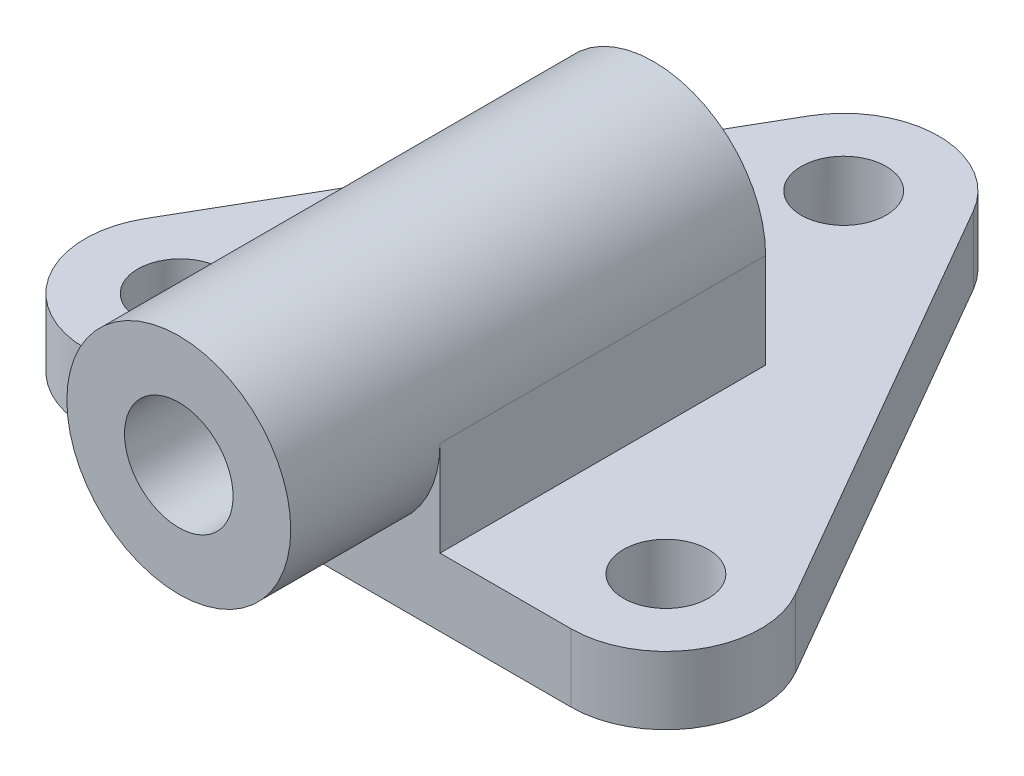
ISO-10303-21;
HEADER;
FILE_DESCRIPTION(('STEP AP214'),'2;1');
FILE_NAME('part.step','',(''),(''),'','','');
FILE_SCHEMA(('AUTOMOTIVE_DESIGN { 1 0 10303 214 1 1 1 1 }'));
ENDSEC;
DATA;
#1=APPLICATION_CONTEXT('core data for automotive mechanical design processes');
#2=APPLICATION_PROTOCOL_DEFINITION('international standard','automotive_design',2000,#1);
#3=PRODUCT_CONTEXT('',#1,'mechanical');
#4=PRODUCT('Part','Part','',(#3));
#5=PRODUCT_RELATED_PRODUCT_CATEGORY('part','',(#4));
#6=PRODUCT_DEFINITION_FORMATION('','',#4);
#7=PRODUCT_DEFINITION_CONTEXT('part definition',#1,'design');
#8=PRODUCT_DEFINITION('design','',#6,#7);
#9=PRODUCT_DEFINITION_SHAPE('','',#8);
#10=(LENGTH_UNIT() NAMED_UNIT(*) SI_UNIT(.MILLI.,.METRE.));
#11=(NAMED_UNIT(*) PLANE_ANGLE_UNIT() SI_UNIT($,.RADIAN.));
#12=(NAMED_UNIT(*) SI_UNIT($,.STERADIAN.) SOLID_ANGLE_UNIT());
#13=UNCERTAINTY_MEASURE_WITH_UNIT(LENGTH_MEASURE(1.E-05),#10,'distance_accuracy_value','');
#14=(GEOMETRIC_REPRESENTATION_CONTEXT(3) GLOBAL_UNCERTAINTY_ASSIGNED_CONTEXT((#13)) GLOBAL_UNIT_ASSIGNED_CONTEXT((#10,
#11,#12)) REPRESENTATION_CONTEXT('',''));
#15=CARTESIAN_POINT('',(0.,0.,0.));
#16=DIRECTION('',(0.,0.,1.));
#17=DIRECTION('',(1.,0.,0.));
#18=AXIS2_PLACEMENT_3D('',#15,#16,#17);
#19=CARTESIAN_POINT('',(-35.7957166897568,10.,34.6666666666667));
#20=DIRECTION('',(0.,0.,-1.));
#21=DIRECTION('',(-1.,0.,0.));
#22=AXIS2_PLACEMENT_3D('',#19,#20,#21);
#23=PLANE('',#22);
#24=CARTESIAN_POINT('',(0.,24.,34.6666666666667));
#25=DIRECTION('',(0.,0.,1.));
#26=DIRECTION('',(1.,0.,0.));
#27=AXIS2_PLACEMENT_3D('',#24,#25,#26);
#28=CIRCLE('',#27,16.5);
#29=CARTESIAN_POINT('',(-16.5,24.,34.6666666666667));
#30=VERTEX_POINT('',#29);
#31=CARTESIAN_POINT('',(16.5,24.,34.6666666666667));
#32=VERTEX_POINT('',#31);
#33=EDGE_CURVE('E131',#30,#32,#28,.T.);
#34=ORIENTED_EDGE('',*,*,#33,.F.);
#35=DIRECTION('',(0.,-1.,0.));
#36=VECTOR('',#35,1.);
#37=CARTESIAN_POINT('',(-16.5,24.,34.6666666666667));
#38=LINE('',#37,#36);
#39=CARTESIAN_POINT('',(-16.5,10.,34.6666666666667));
#40=VERTEX_POINT('',#39);
#41=EDGE_CURVE('E112',#30,#40,#38,.T.);
#42=ORIENTED_EDGE('',*,*,#41,.T.);
#43=DIRECTION('',(1.,0.,0.));
#44=VECTOR('',#43,1.);
#45=CARTESIAN_POINT('',(-35.7957166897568,10.,34.6666666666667));
#46=LINE('',#45,#44);
#47=CARTESIAN_POINT('',(-35.7957166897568,10.,34.6666666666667));
#48=VERTEX_POINT('',#47);
#49=EDGE_CURVE('E199',#48,#40,#46,.T.);
#50=ORIENTED_EDGE('',*,*,#49,.F.);
#51=DIRECTION('',(0.,-1.,0.));
#52=VECTOR('',#51,1.);
#53=CARTESIAN_POINT('',(-35.7957166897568,10.,34.6666666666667));
#54=LINE('',#53,#52);
#55=CARTESIAN_POINT('',(-35.7957166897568,0.,34.6666666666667));
#56=VERTEX_POINT('',#55);
#57=EDGE_CURVE('E226',#48,#56,#54,.T.);
#58=ORIENTED_EDGE('',*,*,#57,.T.);
#59=DIRECTION('',(1.,0.,0.));
#60=VECTOR('',#59,1.);
#61=CARTESIAN_POINT('',(-35.7957166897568,0.,34.6666666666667));
#62=LINE('',#61,#60);
#63=CARTESIAN_POINT('',(35.7957166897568,0.,34.6666666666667));
#64=VERTEX_POINT('',#63);
#65=EDGE_CURVE('E240',#56,#64,#62,.T.);
#66=ORIENTED_EDGE('',*,*,#65,.T.);
#67=DIRECTION('',(0.,-1.,0.));
#68=VECTOR('',#67,1.);
#69=CARTESIAN_POINT('',(35.7957166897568,10.,34.6666666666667));
#70=LINE('',#69,#68);
#71=CARTESIAN_POINT('',(35.7957166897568,10.,34.6666666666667));
#72=VERTEX_POINT('',#71);
#73=EDGE_CURVE('E223',#72,#64,#70,.T.);
#74=ORIENTED_EDGE('',*,*,#73,.F.);
#75=CARTESIAN_POINT('',(16.5,10.,34.6666666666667));
#76=VERTEX_POINT('',#75);
#77=EDGE_CURVE('E205',#76,#72,#46,.T.);
#78=ORIENTED_EDGE('',*,*,#77,.F.);
#79=DIRECTION('',(0.,1.,0.));
#80=VECTOR('',#79,1.);
#81=CARTESIAN_POINT('',(16.5,24.,34.6666666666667));
#82=LINE('',#81,#80);
#83=EDGE_CURVE('E50',#76,#32,#82,.T.);
#84=ORIENTED_EDGE('',*,*,#83,.T.);
#85=EDGE_LOOP('',(#34,#42,#50,#58,#66,#74,#78,#84));
#86=FACE_BOUND('',#85,.T.);
#87=ADVANCED_FACE('F33',(#86),#23,.F.);
#88=CARTESIAN_POINT('',(0.,10.,-41.3333333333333));
#89=DIRECTION('',(0.,-1.,0.));
#90=DIRECTION('',(0.,0.,-1.));
#91=AXIS2_PLACEMENT_3D('',#88,#89,#90);
#92=PLANE('',#91);
#93=CARTESIAN_POINT('',(0.,10.,-41.3333333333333));
#94=DIRECTION('',(0.,1.,0.));
#95=DIRECTION('',(0.,0.,1.));
#96=AXIS2_PLACEMENT_3D('',#93,#94,#95);
#97=CIRCLE('',#96,6.25);
#98=CARTESIAN_POINT('',(0.,10.,-35.0833333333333));
#99=VERTEX_POINT('',#98);
#100=EDGE_CURVE('E186',#99,#99,#97,.T.);
#101=ORIENTED_EDGE('',*,*,#100,.F.);
#102=EDGE_LOOP('',(#101));
#103=FACE_BOUND('',#102,.T.);
#104=CARTESIAN_POINT('',(35.7957166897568,10.,20.6666666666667));
#105=DIRECTION('',(0.,1.,0.));
#106=DIRECTION('',(0.,0.,1.));
#107=AXIS2_PLACEMENT_3D('',#104,#105,#106);
#108=CIRCLE('',#107,6.25);
#109=CARTESIAN_POINT('',(35.7957166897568,10.,26.9166666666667));
#110=VERTEX_POINT('',#109);
#111=EDGE_CURVE('E177',#110,#110,#108,.T.);
#112=ORIENTED_EDGE('',*,*,#111,.F.);
#113=EDGE_LOOP('',(#112));
#114=FACE_BOUND('',#113,.T.);
#115=CARTESIAN_POINT('',(-35.7957166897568,10.,20.6666666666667));
#116=DIRECTION('',(0.,1.,0.));
#117=DIRECTION('',(0.,0.,1.));
#118=AXIS2_PLACEMENT_3D('',#115,#116,#117);
#119=CIRCLE('',#118,6.25);
#120=CARTESIAN_POINT('',(-35.7957166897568,10.,26.9166666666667));
#121=VERTEX_POINT('',#120);
#122=EDGE_CURVE('E174',#121,#121,#119,.T.);
#123=ORIENTED_EDGE('',*,*,#122,.F.);
#124=EDGE_LOOP('',(#123));
#125=FACE_BOUND('',#124,.T.);
#126=DIRECTION('',(0.,0.,1.));
#127=VECTOR('',#126,1.);
#128=CARTESIAN_POINT('',(-16.5,10.,-13.3333333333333));
#129=LINE('',#128,#127);
#130=CARTESIAN_POINT('',(-16.5,10.,-13.3333333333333));
#131=VERTEX_POINT('',#130);
#132=EDGE_CURVE('E119',#131,#40,#129,.T.);
#133=ORIENTED_EDGE('',*,*,#132,.F.);
#134=DIRECTION('',(1.,0.,0.));
#135=VECTOR('',#134,1.);
#136=CARTESIAN_POINT('',(-16.5,10.,-13.3333333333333));
#137=LINE('',#136,#135);
#138=CARTESIAN_POINT('',(16.5,10.,-13.3333333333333));
#139=VERTEX_POINT('',#138);
#140=EDGE_CURVE('E152',#131,#139,#137,.T.);
#141=ORIENTED_EDGE('',*,*,#140,.T.);
#142=DIRECTION('',(0.,0.,1.));
#143=VECTOR('',#142,1.);
#144=CARTESIAN_POINT('',(16.5,10.,-13.3333333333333));
#145=LINE('',#144,#143);
#146=EDGE_CURVE('E160',#139,#76,#145,.T.);
#147=ORIENTED_EDGE('',*,*,#146,.T.);
#148=ORIENTED_EDGE('',*,*,#77,.T.);
#149=CARTESIAN_POINT('',(35.7957166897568,10.,20.6666666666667));
#150=DIRECTION('',(0.,1.,0.));
#151=DIRECTION('',(0.,0.,1.));
#152=AXIS2_PLACEMENT_3D('',#149,#150,#151);
#153=CIRCLE('',#152,14.);
#154=CARTESIAN_POINT('',(47.9200723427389,10.,13.6666666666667));
#155=VERTEX_POINT('',#154);
#156=EDGE_CURVE('E204',#72,#155,#153,.T.);
#157=ORIENTED_EDGE('',*,*,#156,.T.);
#158=DIRECTION('',(-0.5,0.,-0.866025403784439));
#159=VECTOR('',#158,1.);
#160=CARTESIAN_POINT('',(47.9200723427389,10.,13.6666666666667));
#161=LINE('',#160,#159);
#162=CARTESIAN_POINT('',(12.1243556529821,10.,-48.3333333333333));
#163=VERTEX_POINT('',#162);
#164=EDGE_CURVE('E58',#155,#163,#161,.T.);
#165=ORIENTED_EDGE('',*,*,#164,.T.);
#166=CARTESIAN_POINT('',(0.,10.,-41.3333333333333));
#167=DIRECTION('',(0.,1.,0.));
#168=DIRECTION('',(0.,0.,-1.));
#169=AXIS2_PLACEMENT_3D('',#166,#167,#168);
#170=CIRCLE('',#169,14.);
#171=CARTESIAN_POINT('',(-12.1243556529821,10.,-48.3333333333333));
#172=VERTEX_POINT('',#171);
#173=EDGE_CURVE('E249',#163,#172,#170,.T.);
#174=ORIENTED_EDGE('',*,*,#173,.T.);
#175=DIRECTION('',(-0.5,0.,0.866025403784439));
#176=VECTOR('',#175,1.);
#177=CARTESIAN_POINT('',(-12.1243556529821,10.,-48.3333333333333));
#178=LINE('',#177,#176);
#179=CARTESIAN_POINT('',(-47.9200723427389,10.,13.6666666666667));
#180=VERTEX_POINT('',#179);
#181=EDGE_CURVE('E250',#172,#180,#178,.T.);
#182=ORIENTED_EDGE('',*,*,#181,.T.);
#183=CARTESIAN_POINT('',(-35.7957166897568,10.,20.6666666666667));
#184=DIRECTION('',(0.,1.,0.));
#185=DIRECTION('',(0.,0.,1.));
#186=AXIS2_PLACEMENT_3D('',#183,#184,#185);
#187=CIRCLE('',#186,14.);
#188=EDGE_CURVE('E201',#180,#48,#187,.T.);
#189=ORIENTED_EDGE('',*,*,#188,.T.);
#190=ORIENTED_EDGE('',*,*,#49,.T.);
#191=EDGE_LOOP('',(#133,#141,#147,#148,#157,#165,#174,#182,#189,#190));
#192=FACE_BOUND('',#191,.T.);
#193=ADVANCED_FACE('F193',(#103,#114,#125,#192),#92,.F.);
#194=CARTESIAN_POINT('',(0.,10.,-41.3333333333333));
#195=DIRECTION('',(0.,-1.,0.));
#196=DIRECTION('',(0.,0.,-1.));
#197=AXIS2_PLACEMENT_3D('',#194,#195,#196);
#198=CYLINDRICAL_SURFACE('',#197,14.);
#199=CARTESIAN_POINT('',(0.,0.,-41.3333333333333));
#200=DIRECTION('',(0.,1.,0.));
#201=DIRECTION('',(0.,0.,-1.));
#202=AXIS2_PLACEMENT_3D('',#199,#200,#201);
#203=CIRCLE('',#202,14.);
#204=CARTESIAN_POINT('',(12.1243556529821,0.,-48.3333333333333));
#205=VERTEX_POINT('',#204);
#206=CARTESIAN_POINT('',(-12.1243556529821,0.,-48.3333333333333));
#207=VERTEX_POINT('',#206);
#208=EDGE_CURVE('E159',#205,#207,#203,.T.);
#209=ORIENTED_EDGE('',*,*,#208,.T.);
#210=DIRECTION('',(0.,-1.,0.));
#211=VECTOR('',#210,1.);
#212=CARTESIAN_POINT('',(-12.1243556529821,10.,-48.3333333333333));
#213=LINE('',#212,#211);
#214=EDGE_CURVE('E11',#172,#207,#213,.T.);
#215=ORIENTED_EDGE('',*,*,#214,.F.);
#216=ORIENTED_EDGE('',*,*,#173,.F.);
#217=DIRECTION('',(0.,-1.,0.));
#218=VECTOR('',#217,1.);
#219=CARTESIAN_POINT('',(12.1243556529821,10.,-48.3333333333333));
#220=LINE('',#219,#218);
#221=EDGE_CURVE('E217',#163,#205,#220,.T.);
#222=ORIENTED_EDGE('',*,*,#221,.T.);
#223=EDGE_LOOP('',(#209,#215,#216,#222));
#224=FACE_BOUND('',#223,.T.);
#225=ADVANCED_FACE('F35',(#224),#198,.T.);
#226=CARTESIAN_POINT('',(-12.1243556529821,10.,-48.3333333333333));
#227=DIRECTION('',(0.866025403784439,0.,0.5));
#228=DIRECTION('',(0.5,0.,-0.866025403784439));
#229=AXIS2_PLACEMENT_3D('',#226,#227,#228);
#230=PLANE('',#229);
#231=DIRECTION('',(-0.5,0.,0.866025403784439));
#232=VECTOR('',#231,1.);
#233=CARTESIAN_POINT('',(-12.1243556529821,0.,-48.3333333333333));
#234=LINE('',#233,#232);
#235=CARTESIAN_POINT('',(-47.9200723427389,0.,13.6666666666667));
#236=VERTEX_POINT('',#235);
#237=EDGE_CURVE('E238',#207,#236,#234,.T.);
#238=ORIENTED_EDGE('',*,*,#237,.T.);
#239=DIRECTION('',(0.,-1.,0.));
#240=VECTOR('',#239,1.);
#241=CARTESIAN_POINT('',(-47.9200723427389,10.,13.6666666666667));
#242=LINE('',#241,#240);
#243=EDGE_CURVE('E42',#180,#236,#242,.T.);
#244=ORIENTED_EDGE('',*,*,#243,.F.);
#245=ORIENTED_EDGE('',*,*,#181,.F.);
#246=ORIENTED_EDGE('',*,*,#214,.T.);
#247=EDGE_LOOP('',(#238,#244,#245,#246));
#248=FACE_BOUND('',#247,.T.);
#249=ADVANCED_FACE('F253',(#248),#230,.F.);
#250=CARTESIAN_POINT('',(-35.7957166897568,10.,20.6666666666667));
#251=DIRECTION('',(0.,-1.,0.));
#252=DIRECTION('',(0.,0.,-1.));
#253=AXIS2_PLACEMENT_3D('',#250,#251,#252);
#254=CYLINDRICAL_SURFACE('',#253,14.);
#255=CARTESIAN_POINT('',(-35.7957166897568,0.,20.6666666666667));
#256=DIRECTION('',(0.,1.,0.));
#257=DIRECTION('',(0.,0.,1.));
#258=AXIS2_PLACEMENT_3D('',#255,#256,#257);
#259=CIRCLE('',#258,14.);
#260=EDGE_CURVE('E232',#236,#56,#259,.T.);
#261=ORIENTED_EDGE('',*,*,#260,.T.);
#262=ORIENTED_EDGE('',*,*,#57,.F.);
#263=ORIENTED_EDGE('',*,*,#188,.F.);
#264=ORIENTED_EDGE('',*,*,#243,.T.);
#265=EDGE_LOOP('',(#261,#262,#263,#264));
#266=FACE_BOUND('',#265,.T.);
#267=ADVANCED_FACE('F231',(#266),#254,.T.);
#268=CARTESIAN_POINT('',(35.7957166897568,10.,20.6666666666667));
#269=DIRECTION('',(0.,-1.,0.));
#270=DIRECTION('',(0.,0.,-1.));
#271=AXIS2_PLACEMENT_3D('',#268,#269,#270);
#272=CYLINDRICAL_SURFACE('',#271,14.);
#273=CARTESIAN_POINT('',(35.7957166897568,0.,20.6666666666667));
#274=DIRECTION('',(0.,1.,0.));
#275=DIRECTION('',(0.,0.,1.));
#276=AXIS2_PLACEMENT_3D('',#273,#274,#275);
#277=CIRCLE('',#276,14.);
#278=CARTESIAN_POINT('',(47.9200723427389,0.,13.6666666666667));
#279=VERTEX_POINT('',#278);
#280=EDGE_CURVE('E242',#64,#279,#277,.T.);
#281=ORIENTED_EDGE('',*,*,#280,.T.);
#282=DIRECTION('',(0.,-1.,0.));
#283=VECTOR('',#282,1.);
#284=CARTESIAN_POINT('',(47.9200723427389,10.,13.6666666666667));
#285=LINE('',#284,#283);
#286=EDGE_CURVE('E220',#155,#279,#285,.T.);
#287=ORIENTED_EDGE('',*,*,#286,.F.);
#288=ORIENTED_EDGE('',*,*,#156,.F.);
#289=ORIENTED_EDGE('',*,*,#73,.T.);
#290=EDGE_LOOP('',(#281,#287,#288,#289));
#291=FACE_BOUND('',#290,.T.);
#292=ADVANCED_FACE('F262',(#291),#272,.T.);
#293=CARTESIAN_POINT('',(47.9200723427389,10.,13.6666666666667));
#294=DIRECTION('',(-0.866025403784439,0.,0.5));
#295=DIRECTION('',(0.5,0.,0.866025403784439));
#296=AXIS2_PLACEMENT_3D('',#293,#294,#295);
#297=PLANE('',#296);
#298=DIRECTION('',(-0.5,0.,-0.866025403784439));
#299=VECTOR('',#298,1.);
#300=CARTESIAN_POINT('',(47.9200723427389,0.,13.6666666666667));
#301=LINE('',#300,#299);
#302=EDGE_CURVE('E247',#279,#205,#301,.T.);
#303=ORIENTED_EDGE('',*,*,#302,.T.);
#304=ORIENTED_EDGE('',*,*,#221,.F.);
#305=ORIENTED_EDGE('',*,*,#164,.F.);
#306=ORIENTED_EDGE('',*,*,#286,.T.);
#307=EDGE_LOOP('',(#303,#304,#305,#306));
#308=FACE_BOUND('',#307,.T.);
#309=ADVANCED_FACE('F258',(#308),#297,.F.);
#310=CARTESIAN_POINT('',(0.,0.,-41.3333333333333));
#311=DIRECTION('',(0.,-1.,0.));
#312=DIRECTION('',(0.,0.,-1.));
#313=AXIS2_PLACEMENT_3D('',#310,#311,#312);
#314=PLANE('',#313);
#315=CARTESIAN_POINT('',(0.,0.,-41.3333333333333));
#316=DIRECTION('',(0.,-1.,0.));
#317=DIRECTION('',(0.,0.,-1.));
#318=AXIS2_PLACEMENT_3D('',#315,#316,#317);
#319=CIRCLE('',#318,6.25);
#320=CARTESIAN_POINT('',(0.,0.,-47.5833333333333));
#321=VERTEX_POINT('',#320);
#322=EDGE_CURVE('E37',#321,#321,#319,.T.);
#323=ORIENTED_EDGE('',*,*,#322,.F.);
#324=EDGE_LOOP('',(#323));
#325=FACE_BOUND('',#324,.T.);
#326=CARTESIAN_POINT('',(35.7957166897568,0.,20.6666666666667));
#327=DIRECTION('',(0.,-1.,0.));
#328=DIRECTION('',(0.,0.,-1.));
#329=AXIS2_PLACEMENT_3D('',#326,#327,#328);
#330=CIRCLE('',#329,6.25);
#331=CARTESIAN_POINT('',(35.7957166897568,0.,14.4166666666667));
#332=VERTEX_POINT('',#331);
#333=EDGE_CURVE('E175',#332,#332,#330,.T.);
#334=ORIENTED_EDGE('',*,*,#333,.F.);
#335=EDGE_LOOP('',(#334));
#336=FACE_BOUND('',#335,.T.);
#337=CARTESIAN_POINT('',(-35.7957166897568,0.,20.6666666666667));
#338=DIRECTION('',(0.,-1.,0.));
#339=DIRECTION('',(0.,0.,-1.));
#340=AXIS2_PLACEMENT_3D('',#337,#338,#339);
#341=CIRCLE('',#340,6.25);
#342=CARTESIAN_POINT('',(-35.7957166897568,0.,14.4166666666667));
#343=VERTEX_POINT('',#342);
#344=EDGE_CURVE('E143',#343,#343,#341,.T.);
#345=ORIENTED_EDGE('',*,*,#344,.F.);
#346=EDGE_LOOP('',(#345));
#347=FACE_BOUND('',#346,.T.);
#348=ORIENTED_EDGE('',*,*,#208,.F.);
#349=ORIENTED_EDGE('',*,*,#302,.F.);
#350=ORIENTED_EDGE('',*,*,#280,.F.);
#351=ORIENTED_EDGE('',*,*,#65,.F.);
#352=ORIENTED_EDGE('',*,*,#260,.F.);
#353=ORIENTED_EDGE('',*,*,#237,.F.);
#354=EDGE_LOOP('',(#348,#349,#350,#351,#352,#353));
#355=FACE_BOUND('',#354,.T.);
#356=ADVANCED_FACE('F237',(#325,#336,#347,#355),#314,.T.);
#357=CARTESIAN_POINT('',(0.,24.,-13.3333333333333));
#358=DIRECTION('',(0.,0.,1.));
#359=DIRECTION('',(1.,0.,0.));
#360=AXIS2_PLACEMENT_3D('',#357,#358,#359);
#361=CYLINDRICAL_SURFACE('',#360,16.5);
#362=DIRECTION('',(0.,0.,1.));
#363=VECTOR('',#362,1.);
#364=CARTESIAN_POINT('',(-16.5,24.,-13.3333333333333));
#365=LINE('',#364,#363);
#366=CARTESIAN_POINT('',(-16.5,24.,-13.3333333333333));
#367=VERTEX_POINT('',#366);
#368=EDGE_CURVE('E116',#367,#30,#365,.T.);
#369=ORIENTED_EDGE('',*,*,#368,.T.);
#370=ORIENTED_EDGE('',*,*,#33,.T.);
#371=DIRECTION('',(0.,0.,1.));
#372=VECTOR('',#371,1.);
#373=CARTESIAN_POINT('',(16.5,24.,-13.3333333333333));
#374=LINE('',#373,#372);
#375=CARTESIAN_POINT('',(16.5,24.,-13.3333333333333));
#376=VERTEX_POINT('',#375);
#377=EDGE_CURVE('E157',#376,#32,#374,.T.);
#378=ORIENTED_EDGE('',*,*,#377,.F.);
#379=CARTESIAN_POINT('',(0.,24.,-13.3333333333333));
#380=DIRECTION('',(0.,0.,1.));
#381=DIRECTION('',(1.,0.,0.));
#382=AXIS2_PLACEMENT_3D('',#379,#380,#381);
#383=CIRCLE('',#382,16.5);
#384=EDGE_CURVE('E133',#376,#367,#383,.T.);
#385=ORIENTED_EDGE('',*,*,#384,.T.);
#386=EDGE_LOOP('',(#369,#370,#378,#385));
#387=FACE_BOUND('',#386,.T.);
#388=CARTESIAN_POINT('',(0.,24.,56.6666666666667));
#389=DIRECTION('',(0.,0.,1.));
#390=DIRECTION('',(1.,0.,0.));
#391=AXIS2_PLACEMENT_3D('',#388,#389,#390);
#392=CIRCLE('',#391,16.5);
#393=CARTESIAN_POINT('',(16.5,24.,56.6666666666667));
#394=VERTEX_POINT('',#393);
#395=EDGE_CURVE('E137',#394,#394,#392,.T.);
#396=ORIENTED_EDGE('',*,*,#395,.F.);
#397=EDGE_LOOP('',(#396));
#398=FACE_BOUND('',#397,.T.);
#399=ADVANCED_FACE('F129',(#387,#398),#361,.T.);
#400=CARTESIAN_POINT('',(16.5,24.,-13.3333333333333));
#401=DIRECTION('',(1.,0.,0.));
#402=DIRECTION('',(0.,0.,-1.));
#403=AXIS2_PLACEMENT_3D('',#400,#401,#402);
#404=PLANE('',#403);
#405=ORIENTED_EDGE('',*,*,#83,.F.);
#406=ORIENTED_EDGE('',*,*,#146,.F.);
#407=DIRECTION('',(0.,1.,0.));
#408=VECTOR('',#407,1.);
#409=CARTESIAN_POINT('',(16.5,24.,-13.3333333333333));
#410=LINE('',#409,#408);
#411=EDGE_CURVE('E134',#139,#376,#410,.T.);
#412=ORIENTED_EDGE('',*,*,#411,.T.);
#413=ORIENTED_EDGE('',*,*,#377,.T.);
#414=EDGE_LOOP('',(#405,#406,#412,#413));
#415=FACE_BOUND('',#414,.T.);
#416=ADVANCED_FACE('F265',(#415),#404,.T.);
#417=CARTESIAN_POINT('',(-16.5,24.,-13.3333333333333));
#418=DIRECTION('',(-1.,0.,0.));
#419=DIRECTION('',(0.,0.,1.));
#420=AXIS2_PLACEMENT_3D('',#417,#418,#419);
#421=PLANE('',#420);
#422=ORIENTED_EDGE('',*,*,#41,.F.);
#423=ORIENTED_EDGE('',*,*,#368,.F.);
#424=DIRECTION('',(0.,-1.,0.));
#425=VECTOR('',#424,1.);
#426=CARTESIAN_POINT('',(-16.5,24.,-13.3333333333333));
#427=LINE('',#426,#425);
#428=EDGE_CURVE('E150',#367,#131,#427,.T.);
#429=ORIENTED_EDGE('',*,*,#428,.T.);
#430=ORIENTED_EDGE('',*,*,#132,.T.);
#431=EDGE_LOOP('',(#422,#423,#429,#430));
#432=FACE_BOUND('',#431,.T.);
#433=ADVANCED_FACE('F114',(#432),#421,.T.);
#434=CARTESIAN_POINT('',(0.,24.,-13.3333333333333));
#435=DIRECTION('',(0.,0.,1.));
#436=DIRECTION('',(1.,0.,0.));
#437=AXIS2_PLACEMENT_3D('',#434,#435,#436);
#438=PLANE('',#437);
#439=CARTESIAN_POINT('',(0.,24.,-13.3333333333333));
#440=DIRECTION('',(0.,0.,1.));
#441=DIRECTION('',(1.,0.,0.));
#442=AXIS2_PLACEMENT_3D('',#439,#440,#441);
#443=CIRCLE('',#442,8.);
#444=CARTESIAN_POINT('',(8.,24.,-13.3333333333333));
#445=VERTEX_POINT('',#444);
#446=EDGE_CURVE('E124',#445,#445,#443,.T.);
#447=ORIENTED_EDGE('',*,*,#446,.T.);
#448=EDGE_LOOP('',(#447));
#449=FACE_BOUND('',#448,.T.);
#450=ORIENTED_EDGE('',*,*,#384,.F.);
#451=ORIENTED_EDGE('',*,*,#411,.F.);
#452=ORIENTED_EDGE('',*,*,#140,.F.);
#453=ORIENTED_EDGE('',*,*,#428,.F.);
#454=EDGE_LOOP('',(#450,#451,#452,#453));
#455=FACE_BOUND('',#454,.T.);
#456=ADVANCED_FACE('F267',(#449,#455),#438,.F.);
#457=CARTESIAN_POINT('',(0.,24.,-13.3333333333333));
#458=DIRECTION('',(0.,0.,1.));
#459=DIRECTION('',(1.,0.,0.));
#460=AXIS2_PLACEMENT_3D('',#457,#458,#459);
#461=CYLINDRICAL_SURFACE('',#460,8.);
#462=ORIENTED_EDGE('',*,*,#446,.F.);
#463=EDGE_LOOP('',(#462));
#464=FACE_BOUND('',#463,.T.);
#465=CARTESIAN_POINT('',(0.,24.,56.6666666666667));
#466=DIRECTION('',(0.,0.,1.));
#467=DIRECTION('',(1.,0.,0.));
#468=AXIS2_PLACEMENT_3D('',#465,#466,#467);
#469=CIRCLE('',#468,8.);
#470=CARTESIAN_POINT('',(8.,24.,56.6666666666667));
#471=VERTEX_POINT('',#470);
#472=EDGE_CURVE('E138',#471,#471,#469,.T.);
#473=ORIENTED_EDGE('',*,*,#472,.T.);
#474=EDGE_LOOP('',(#473));
#475=FACE_BOUND('',#474,.T.);
#476=ADVANCED_FACE('F269',(#464,#475),#461,.F.);
#477=CARTESIAN_POINT('',(0.,24.,56.6666666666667));
#478=DIRECTION('',(0.,0.,1.));
#479=DIRECTION('',(1.,0.,0.));
#480=AXIS2_PLACEMENT_3D('',#477,#478,#479);
#481=PLANE('',#480);
#482=ORIENTED_EDGE('',*,*,#395,.T.);
#483=EDGE_LOOP('',(#482));
#484=FACE_BOUND('',#483,.T.);
#485=ORIENTED_EDGE('',*,*,#472,.F.);
#486=EDGE_LOOP('',(#485));
#487=FACE_BOUND('',#486,.T.);
#488=ADVANCED_FACE('F276',(#484,#487),#481,.T.);
#489=CARTESIAN_POINT('',(-35.7957166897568,10.,20.6666666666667));
#490=DIRECTION('',(0.,1.,0.));
#491=DIRECTION('',(0.,0.,1.));
#492=AXIS2_PLACEMENT_3D('',#489,#490,#491);
#493=CYLINDRICAL_SURFACE('',#492,6.25);
#494=ORIENTED_EDGE('',*,*,#344,.T.);
#495=EDGE_LOOP('',(#494));
#496=FACE_BOUND('',#495,.T.);
#497=ORIENTED_EDGE('',*,*,#122,.T.);
#498=EDGE_LOOP('',(#497));
#499=FACE_BOUND('',#498,.T.);
#500=ADVANCED_FACE('F322',(#496,#499),#493,.F.);
#501=CARTESIAN_POINT('',(35.7957166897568,10.,20.6666666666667));
#502=DIRECTION('',(0.,1.,0.));
#503=DIRECTION('',(0.,0.,1.));
#504=AXIS2_PLACEMENT_3D('',#501,#502,#503);
#505=CYLINDRICAL_SURFACE('',#504,6.25);
#506=ORIENTED_EDGE('',*,*,#333,.T.);
#507=EDGE_LOOP('',(#506));
#508=FACE_BOUND('',#507,.T.);
#509=ORIENTED_EDGE('',*,*,#111,.T.);
#510=EDGE_LOOP('',(#509));
#511=FACE_BOUND('',#510,.T.);
#512=ADVANCED_FACE('F327',(#508,#511),#505,.F.);
#513=CARTESIAN_POINT('',(0.,10.,-41.3333333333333));
#514=DIRECTION('',(0.,1.,0.));
#515=DIRECTION('',(0.,0.,1.));
#516=AXIS2_PLACEMENT_3D('',#513,#514,#515);
#517=CYLINDRICAL_SURFACE('',#516,6.25);
#518=ORIENTED_EDGE('',*,*,#322,.T.);
#519=EDGE_LOOP('',(#518));
#520=FACE_BOUND('',#519,.T.);
#521=ORIENTED_EDGE('',*,*,#100,.T.);
#522=EDGE_LOOP('',(#521));
#523=FACE_BOUND('',#522,.T.);
#524=ADVANCED_FACE('F191',(#520,#523),#517,.F.);
#525=CLOSED_SHELL('',(#87,#193,#225,#249,#267,#292,#309,#356,#399,#416,#433,#456,#476,#488,#500,
#512,#524));
#526=MANIFOLD_SOLID_BREP('B2',#525);
#527=ADVANCED_BREP_SHAPE_REPRESENTATION('',(#18,#526),#14);
#528=SHAPE_DEFINITION_REPRESENTATION(#9,#527);
ENDSEC;
END-ISO-10303-21;
